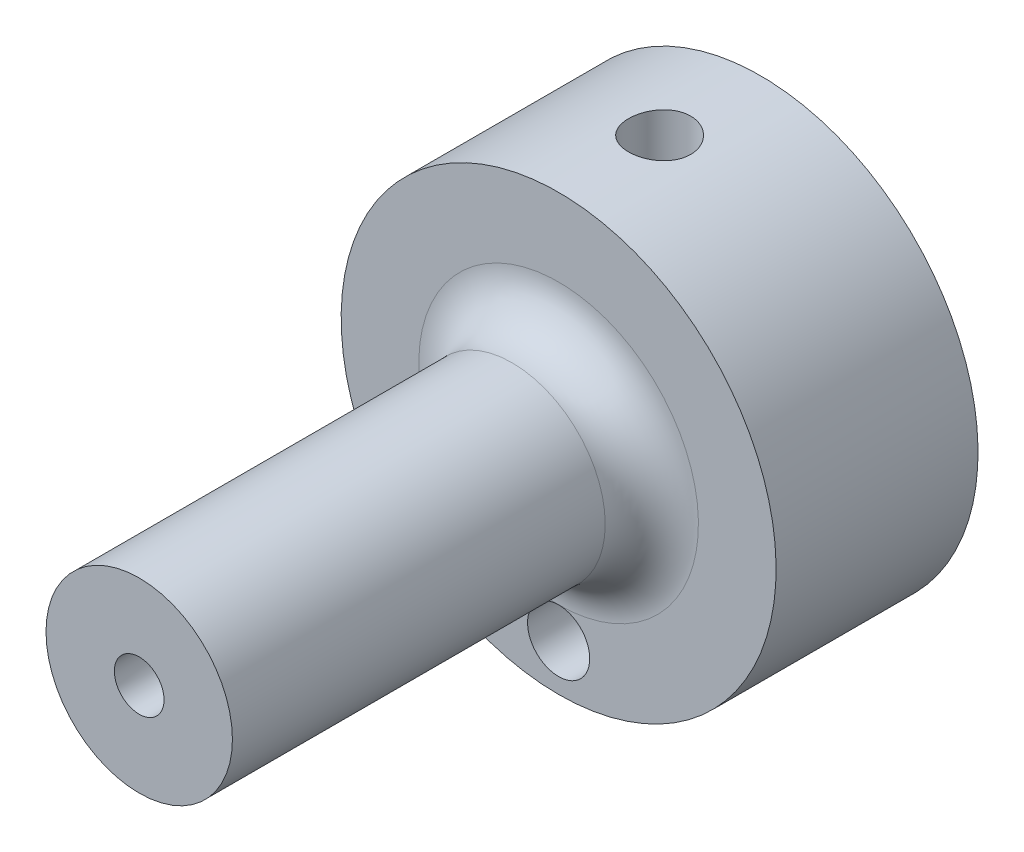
ISO-10303-21;
HEADER;
FILE_DESCRIPTION(('STEP AP214'),'2;1');
FILE_NAME('part.step','',(''),(''),'','','');
FILE_SCHEMA(('AUTOMOTIVE_DESIGN { 1 0 10303 214 1 1 1 1 }'));
ENDSEC;
DATA;
#1=APPLICATION_CONTEXT('core data for automotive mechanical design processes');
#2=APPLICATION_PROTOCOL_DEFINITION('international standard','automotive_design',2000,#1);
#3=PRODUCT_CONTEXT('',#1,'mechanical');
#4=PRODUCT('Part','Part','',(#3));
#5=PRODUCT_RELATED_PRODUCT_CATEGORY('part','',(#4));
#6=PRODUCT_DEFINITION_FORMATION('','',#4);
#7=PRODUCT_DEFINITION_CONTEXT('part definition',#1,'design');
#8=PRODUCT_DEFINITION('design','',#6,#7);
#9=PRODUCT_DEFINITION_SHAPE('','',#8);
#10=(LENGTH_UNIT() NAMED_UNIT(*) SI_UNIT(.MILLI.,.METRE.));
#11=(NAMED_UNIT(*) PLANE_ANGLE_UNIT() SI_UNIT($,.RADIAN.));
#12=(NAMED_UNIT(*) SI_UNIT($,.STERADIAN.) SOLID_ANGLE_UNIT());
#13=UNCERTAINTY_MEASURE_WITH_UNIT(LENGTH_MEASURE(1.E-05),#10,'distance_accuracy_value','');
#14=(GEOMETRIC_REPRESENTATION_CONTEXT(3) GLOBAL_UNCERTAINTY_ASSIGNED_CONTEXT((#13)) GLOBAL_UNIT_ASSIGNED_CONTEXT((#10,
#11,#12)) REPRESENTATION_CONTEXT('',''));
#15=CARTESIAN_POINT('',(0.,0.,0.));
#16=DIRECTION('',(0.,0.,1.));
#17=DIRECTION('',(1.,0.,0.));
#18=AXIS2_PLACEMENT_3D('',#15,#16,#17);
#19=CARTESIAN_POINT('',(0.,0.,27.));
#20=DIRECTION('',(0.,0.,1.));
#21=DIRECTION('',(0.,-1.,0.));
#22=AXIS2_PLACEMENT_3D('',#19,#20,#21);
#23=CONICAL_SURFACE('',#22,1.59907471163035,0.00872664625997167);
#24=CARTESIAN_POINT('',(0.,0.,27.));
#25=DIRECTION('',(0.,0.,1.));
#26=DIRECTION('',(0.,-1.,0.));
#27=AXIS2_PLACEMENT_3D('',#24,#25,#26);
#28=CIRCLE('',#27,1.59907471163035);
#29=CARTESIAN_POINT('',(0.,-1.59907471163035,27.));
#30=VERTEX_POINT('',#29);
#31=EDGE_CURVE('E110',#30,#30,#28,.T.);
#32=ORIENTED_EDGE('',*,*,#31,.T.);
#33=EDGE_LOOP('',(#32));
#34=FACE_BOUND('',#33,.T.);
#35=CARTESIAN_POINT('',(0.,0.,-11.5515133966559));
#36=DIRECTION('',(0.,0.,-1.));
#37=DIRECTION('',(0.,1.,0.));
#38=AXIS2_PLACEMENT_3D('',#35,#36,#37);
#39=CIRCLE('',#38,1.26264075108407);
#40=CARTESIAN_POINT('',(0.,1.26264075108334,-11.5515133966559));
#41=VERTEX_POINT('',#40);
#42=EDGE_CURVE('E38',#41,#41,#39,.F.);
#43=ORIENTED_EDGE('',*,*,#42,.F.);
#44=EDGE_LOOP('',(#43));
#45=FACE_BOUND('',#44,.T.);
#46=ADVANCED_FACE('F34',(#34,#45),#23,.F.);
#47=CARTESIAN_POINT('',(0.,0.,27.));
#48=DIRECTION('',(0.,0.,1.));
#49=DIRECTION('',(0.,-1.,0.));
#50=AXIS2_PLACEMENT_3D('',#47,#48,#49);
#51=CYLINDRICAL_SURFACE('',#50,14.);
#52=CARTESIAN_POINT('',(0.,0.,0.));
#53=DIRECTION('',(0.,0.,1.));
#54=DIRECTION('',(0.,-1.,0.));
#55=AXIS2_PLACEMENT_3D('',#52,#53,#54);
#56=CIRCLE('',#55,14.);
#57=CARTESIAN_POINT('',(0.,-14.,0.));
#58=VERTEX_POINT('',#57);
#59=EDGE_CURVE('E104',#58,#58,#56,.T.);
#60=ORIENTED_EDGE('',*,*,#59,.F.);
#61=EDGE_LOOP('',(#60));
#62=FACE_BOUND('',#61,.T.);
#63=CARTESIAN_POINT('',(0.,0.,-13.));
#64=DIRECTION('',(0.,0.,1.));
#65=DIRECTION('',(0.,-1.,0.));
#66=AXIS2_PLACEMENT_3D('',#63,#64,#65);
#67=CIRCLE('',#66,14.);
#68=CARTESIAN_POINT('',(0.,-14.,-13.));
#69=VERTEX_POINT('',#68);
#70=EDGE_CURVE('E107',#69,#69,#67,.T.);
#71=ORIENTED_EDGE('',*,*,#70,.T.);
#72=EDGE_LOOP('',(#71));
#73=FACE_BOUND('',#72,.T.);
#74=CARTESIAN_POINT('',(0.,14.,-4.5));
#75=CARTESIAN_POINT('',(0.111730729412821,13.9999982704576,-4.50000465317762));
#76=CARTESIAN_POINT('',(0.223527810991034,13.9986484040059,-4.50939441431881));
#77=CARTESIAN_POINT('',(0.444001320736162,13.9933934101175,-4.54669827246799));
#78=CARTESIAN_POINT('',(0.552674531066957,13.9894857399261,-4.57463080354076));
#79=CARTESIAN_POINT('',(0.763677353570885,13.9795546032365,-4.64817212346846));
#80=CARTESIAN_POINT('',(0.866011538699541,13.9735326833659,-4.69376799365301));
#81=CARTESIAN_POINT('',(1.06155930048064,13.9600397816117,-4.80131108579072));
#82=CARTESIAN_POINT('',(1.1547742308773,13.9525690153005,-4.86325587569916));
#83=CARTESIAN_POINT('',(1.33011730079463,13.9369507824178,-5.00220834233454));
#84=CARTESIAN_POINT('',(1.4121711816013,13.9287993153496,-5.07930928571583));
#85=CARTESIAN_POINT('',(1.56222258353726,13.9127699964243,-5.24618482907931));
#86=CARTESIAN_POINT('',(1.63021932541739,13.9048921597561,-5.33596013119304));
#87=CARTESIAN_POINT('',(1.75051175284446,13.8902631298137,-5.52613023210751));
#88=CARTESIAN_POINT('',(1.80273625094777,13.8835171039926,-5.62657049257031));
#89=CARTESIAN_POINT('',(1.8895469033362,13.8719696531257,-5.83490907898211));
#90=CARTESIAN_POINT('',(1.92413392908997,13.8671681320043,-5.94280703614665));
#91=CARTESIAN_POINT('',(1.97445864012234,13.8600923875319,-6.16222001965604));
#92=CARTESIAN_POINT('',(1.99032297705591,13.8578011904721,-6.27370543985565));
#93=CARTESIAN_POINT('',(2.00314420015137,13.8559538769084,-6.4977778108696));
#94=CARTESIAN_POINT('',(2.00010207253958,13.8563976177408,-6.61036470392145));
#95=CARTESIAN_POINT('',(1.97530036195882,13.8599545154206,-6.83255309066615));
#96=CARTESIAN_POINT('',(1.95368136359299,13.8630476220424,-6.94217064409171));
#97=CARTESIAN_POINT('',(1.89255944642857,13.8715234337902,-7.15620617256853));
#98=CARTESIAN_POINT('',(1.85305606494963,13.8769061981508,-7.26062401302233));
#99=CARTESIAN_POINT('',(1.75713904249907,13.8893771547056,-7.46172654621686));
#100=CARTESIAN_POINT('',(1.70066538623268,13.8964713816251,-7.55838222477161));
#101=CARTESIAN_POINT('',(1.57245369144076,13.9115614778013,-7.7408984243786));
#102=CARTESIAN_POINT('',(1.50071474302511,13.9195574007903,-7.82675830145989));
#103=CARTESIAN_POINT('',(1.34323491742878,13.935638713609,-7.98606080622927));
#104=CARTESIAN_POINT('',(1.25737307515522,13.9437242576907,-8.05938389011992));
#105=CARTESIAN_POINT('',(1.07449831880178,13.9590063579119,-8.19059700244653));
#106=CARTESIAN_POINT('',(0.97748536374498,13.9662029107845,-8.24848697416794));
#107=CARTESIAN_POINT('',(0.774962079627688,13.9789027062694,-8.34719487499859));
#108=CARTESIAN_POINT('',(0.66944745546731,13.9844050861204,-8.38800410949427));
#109=CARTESIAN_POINT('',(0.452966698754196,13.9930891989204,-8.4512909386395));
#110=CARTESIAN_POINT('',(0.342000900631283,13.9962710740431,-8.47376965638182));
#111=CARTESIAN_POINT('',(0.118800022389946,13.9999369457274,-8.49959962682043));
#112=CARTESIAN_POINT('',(0.00658433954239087,14.0004441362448,-8.5031153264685));
#113=CARTESIAN_POINT('',(-0.216834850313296,13.998766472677,-8.49135519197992));
#114=CARTESIAN_POINT('',(-0.328038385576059,13.9965816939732,-8.47607988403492));
#115=CARTESIAN_POINT('',(-0.545782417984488,13.989779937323,-8.42730805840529));
#116=CARTESIAN_POINT('',(-0.652341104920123,13.9851735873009,-8.39389114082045));
#117=CARTESIAN_POINT('',(-0.858342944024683,13.9740437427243,-8.30986826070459));
#118=CARTESIAN_POINT('',(-0.957785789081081,13.9675201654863,-8.25926155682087));
#119=CARTESIAN_POINT('',(-1.14745969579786,13.9532237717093,-8.14190618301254));
#120=CARTESIAN_POINT('',(-1.23762521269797,13.9454429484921,-8.07505257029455));
#121=CARTESIAN_POINT('',(-1.40551529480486,13.9295244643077,-7.92724792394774));
#122=CARTESIAN_POINT('',(-1.48323920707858,13.9213867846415,-7.84629615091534));
#123=CARTESIAN_POINT('',(-1.62463364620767,13.905598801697,-7.67186329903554));
#124=CARTESIAN_POINT('',(-1.68819430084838,13.8979526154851,-7.57829272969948));
#125=CARTESIAN_POINT('',(-1.79869568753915,13.8840847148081,-7.38170681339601));
#126=CARTESIAN_POINT('',(-1.84563683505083,13.8778629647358,-7.27869170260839));
#127=CARTESIAN_POINT('',(-1.92139410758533,13.8675777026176,-7.06647669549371));
#128=CARTESIAN_POINT('',(-1.95026930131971,13.8635071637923,-6.95729824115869));
#129=CARTESIAN_POINT('',(-1.98926373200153,13.8579660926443,-6.7355794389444));
#130=CARTESIAN_POINT('',(-1.99938413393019,13.8564953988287,-6.62303930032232));
#131=CARTESIAN_POINT('',(-2.00055590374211,13.8563261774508,-6.39888617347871));
#132=CARTESIAN_POINT('',(-1.99177997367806,13.8576025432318,-6.28727406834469));
#133=CARTESIAN_POINT('',(-1.955776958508,13.8627292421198,-6.06712987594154));
#134=CARTESIAN_POINT('',(-1.92854989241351,13.8665795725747,-5.95859778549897));
#135=CARTESIAN_POINT('',(-1.85647645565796,13.8764118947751,-5.74773473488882));
#136=CARTESIAN_POINT('',(-1.81164102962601,13.8823925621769,-5.64539996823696));
#137=CARTESIAN_POINT('',(-1.70564064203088,13.8958134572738,-5.4496775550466));
#138=CARTESIAN_POINT('',(-1.6444752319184,13.9032537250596,-5.35629015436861));
#139=CARTESIAN_POINT('',(-1.50691947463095,13.9188366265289,-5.18023418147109));
#140=CARTESIAN_POINT('',(-1.43040092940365,13.9269848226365,-5.09766625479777));
#141=CARTESIAN_POINT('',(-1.26458151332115,13.9430182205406,-4.94648029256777));
#142=CARTESIAN_POINT('',(-1.17527766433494,13.9509033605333,-4.87786551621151));
#143=CARTESIAN_POINT('',(-0.985903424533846,13.9655666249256,-4.75623242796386));
#144=CARTESIAN_POINT('',(-0.885781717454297,13.9723390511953,-4.70329334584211));
#145=CARTESIAN_POINT('',(-0.678021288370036,13.9839575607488,-4.6150602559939));
#146=CARTESIAN_POINT('',(-0.570390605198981,13.9888056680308,-4.57974769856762));
#147=CARTESIAN_POINT('',(-0.385211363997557,13.9949036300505,-4.53591641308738));
#148=CARTESIAN_POINT('',(-0.308813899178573,13.9968051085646,-4.52246796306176));
#149=CARTESIAN_POINT('',(-0.154954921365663,13.9993538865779,-4.5045081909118));
#150=CARTESIAN_POINT('',(-0.0774934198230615,14.0000011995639,-4.49999677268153));
#151=CARTESIAN_POINT('',(0.,14.,-4.5));
#152=B_SPLINE_CURVE_WITH_KNOTS('',3,(#74,#75,#76,#77,#78,#79,#80,#81,#82,#83,#84,#85,#86,#87,
#88,#89,#90,#91,#92,#93,#94,#95,#96,#97,#98,#99,#100,#101,#102,#103,#104,#105,#106,#107,#108,
#109,#110,#111,#112,#113,#114,#115,#116,#117,#118,#119,#120,#121,#122,#123,#124,#125,#126,#127,
#128,#129,#130,#131,#132,#133,#134,#135,#136,#137,#138,#139,#140,#141,#142,#143,#144,#145,#146,
#147,#148,#149,#150,#151),.UNSPECIFIED.,.T.,.F.,(4,2,2,2,2,2,2,2,2,2,2,2,2,2,2,2,2,2,2,2,2,2,2,
2,2,2,2,2,2,2,2,2,2,2,2,2,2,2,4),(0.,0.334909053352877,0.670151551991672,1.0051493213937,
1.34009728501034,1.67717486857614,2.01427113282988,2.35286688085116,2.69144589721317,
3.02772118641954,3.36397893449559,3.69771416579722,4.03145803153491,4.36639635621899,
4.70135465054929,5.03934756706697,5.37734172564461,5.71550772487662,6.05365300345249,
6.38886112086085,6.7240598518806,7.05779957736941,7.39155369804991,7.7275237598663,
8.06351144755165,8.40202124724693,8.74052258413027,9.0779112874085,9.41527903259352,
9.74957651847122,10.0838736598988,10.4179633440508,10.7520622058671,11.0890764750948,
11.4261693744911,11.7649380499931,12.1033494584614,12.3356358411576,12.5679197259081),.UNSPECIFIED.);
#153=CARTESIAN_POINT('',(0.,14.,-4.5));
#154=VERTEX_POINT('',#153);
#155=EDGE_CURVE('E11',#154,#154,#152,.T.);
#156=ORIENTED_EDGE('',*,*,#155,.F.);
#157=EDGE_LOOP('',(#156));
#158=FACE_BOUND('',#157,.T.);
#159=ADVANCED_FACE('F71',(#62,#73,#158),#51,.T.);
#160=CARTESIAN_POINT('',(0.,6.,27.));
#161=DIRECTION('',(0.,0.,-1.));
#162=DIRECTION('',(0.,1.,0.));
#163=AXIS2_PLACEMENT_3D('',#160,#161,#162);
#164=PLANE('',#163);
#165=ORIENTED_EDGE('',*,*,#31,.F.);
#166=EDGE_LOOP('',(#165));
#167=FACE_BOUND('',#166,.T.);
#168=CARTESIAN_POINT('',(0.,0.,27.));
#169=DIRECTION('',(0.,0.,1.));
#170=DIRECTION('',(0.,-1.,0.));
#171=AXIS2_PLACEMENT_3D('',#168,#169,#170);
#172=CIRCLE('',#171,6.);
#173=CARTESIAN_POINT('',(0.,-6.,27.));
#174=VERTEX_POINT('',#173);
#175=EDGE_CURVE('E43',#174,#174,#172,.T.);
#176=ORIENTED_EDGE('',*,*,#175,.T.);
#177=EDGE_LOOP('',(#176));
#178=FACE_BOUND('',#177,.T.);
#179=ADVANCED_FACE('F36',(#167,#178),#164,.F.);
#180=CARTESIAN_POINT('',(0.,0.,27.));
#181=DIRECTION('',(0.,0.,1.));
#182=DIRECTION('',(0.,-1.,0.));
#183=AXIS2_PLACEMENT_3D('',#180,#181,#182);
#184=CYLINDRICAL_SURFACE('',#183,6.);
#185=ORIENTED_EDGE('',*,*,#175,.F.);
#186=EDGE_LOOP('',(#185));
#187=FACE_BOUND('',#186,.T.);
#188=CARTESIAN_POINT('',(0.,0.,3.));
#189=DIRECTION('',(0.,0.,1.));
#190=DIRECTION('',(0.,-1.,0.));
#191=AXIS2_PLACEMENT_3D('',#188,#189,#190);
#192=CIRCLE('',#191,6.);
#193=CARTESIAN_POINT('',(0.,-6.,3.));
#194=VERTEX_POINT('',#193);
#195=EDGE_CURVE('E98',#194,#194,#192,.T.);
#196=ORIENTED_EDGE('',*,*,#195,.T.);
#197=EDGE_LOOP('',(#196));
#198=FACE_BOUND('',#197,.T.);
#199=ADVANCED_FACE('F179',(#187,#198),#184,.T.);
#200=CARTESIAN_POINT('',(0.,0.,3.));
#201=DIRECTION('',(0.,0.,1.));
#202=DIRECTION('',(0.,-1.,0.));
#203=AXIS2_PLACEMENT_3D('',#200,#201,#202);
#204=TOROIDAL_SURFACE('',#203,9.,3.);
#205=ORIENTED_EDGE('',*,*,#195,.F.);
#206=EDGE_LOOP('',(#205));
#207=FACE_BOUND('',#206,.T.);
#208=CARTESIAN_POINT('',(0.,0.,0.));
#209=DIRECTION('',(0.,0.,1.));
#210=DIRECTION('',(0.,-1.,0.));
#211=AXIS2_PLACEMENT_3D('',#208,#209,#210);
#212=CIRCLE('',#211,9.00000000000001);
#213=CARTESIAN_POINT('',(0.,-9.00000000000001,0.));
#214=VERTEX_POINT('',#213);
#215=EDGE_CURVE('E101',#214,#214,#212,.T.);
#216=ORIENTED_EDGE('',*,*,#215,.T.);
#217=EDGE_LOOP('',(#216));
#218=FACE_BOUND('',#217,.T.);
#219=ADVANCED_FACE('F175',(#207,#218),#204,.F.);
#220=CARTESIAN_POINT('',(0.,14.,0.));
#221=DIRECTION('',(0.,0.,-1.));
#222=DIRECTION('',(0.,1.,0.));
#223=AXIS2_PLACEMENT_3D('',#220,#221,#222);
#224=PLANE('',#223);
#225=ORIENTED_EDGE('',*,*,#215,.F.);
#226=CARTESIAN_POINT('',(0.,-11.,0.));
#227=DIRECTION('',(0.,0.,1.));
#228=DIRECTION('',(1.,0.,0.));
#229=AXIS2_PLACEMENT_3D('',#226,#227,#228);
#230=CIRCLE('',#229,2.);
#231=EDGE_CURVE('E48',#214,#214,#230,.T.);
#232=ORIENTED_EDGE('',*,*,#231,.F.);
#233=EDGE_LOOP('',(#225,#232));
#234=FACE_BOUND('',#233,.T.);
#235=ORIENTED_EDGE('',*,*,#59,.T.);
#236=EDGE_LOOP('',(#235));
#237=FACE_BOUND('',#236,.T.);
#238=ADVANCED_FACE('F88',(#234,#237),#224,.F.);
#239=CARTESIAN_POINT('',(0.,1.25,-13.));
#240=DIRECTION('',(0.,0.,1.));
#241=DIRECTION('',(0.,-1.,0.));
#242=AXIS2_PLACEMENT_3D('',#239,#240,#241);
#243=PLANE('',#242);
#244=CARTESIAN_POINT('',(0.,0.,-13.));
#245=DIRECTION('',(0.,0.,1.));
#246=DIRECTION('',(0.,-1.,0.));
#247=AXIS2_PLACEMENT_3D('',#244,#245,#246);
#248=CIRCLE('',#247,6.65206734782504);
#249=CARTESIAN_POINT('',(0.,6.65206734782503,-13.));
#250=VERTEX_POINT('',#249);
#251=EDGE_CURVE('E118',#250,#250,#248,.T.);
#252=ORIENTED_EDGE('',*,*,#251,.T.);
#253=EDGE_LOOP('',(#252));
#254=FACE_BOUND('',#253,.T.);
#255=ORIENTED_EDGE('',*,*,#70,.F.);
#256=EDGE_LOOP('',(#255));
#257=FACE_BOUND('',#256,.T.);
#258=ADVANCED_FACE('F86',(#254,#257),#243,.F.);
#259=CARTESIAN_POINT('',(0.,14.,-6.5));
#260=DIRECTION('',(0.,1.,0.));
#261=DIRECTION('',(0.,0.,1.));
#262=AXIS2_PLACEMENT_3D('',#259,#260,#261);
#263=CYLINDRICAL_SURFACE('',#262,2.);
#264=CARTESIAN_POINT('',(0.,8.,-6.5));
#265=DIRECTION('',(0.,1.,0.));
#266=DIRECTION('',(0.,0.,1.));
#267=AXIS2_PLACEMENT_3D('',#264,#265,#266);
#268=CIRCLE('',#267,2.);
#269=CARTESIAN_POINT('',(0.,8.,-4.5));
#270=VERTEX_POINT('',#269);
#271=EDGE_CURVE('E112',#270,#270,#268,.T.);
#272=ORIENTED_EDGE('',*,*,#271,.F.);
#273=EDGE_LOOP('',(#272));
#274=FACE_BOUND('',#273,.T.);
#275=ORIENTED_EDGE('',*,*,#155,.T.);
#276=EDGE_LOOP('',(#275));
#277=FACE_BOUND('',#276,.T.);
#278=ADVANCED_FACE('F83',(#274,#277),#263,.F.);
#279=CARTESIAN_POINT('',(0.,6.79827876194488,-6.5));
#280=DIRECTION('',(0.,1.,0.));
#281=DIRECTION('',(0.,0.,1.));
#282=AXIS2_PLACEMENT_3D('',#279,#280,#281);
#283=CONICAL_SURFACE('',#282,0.,1.02974425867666);
#284=ORIENTED_EDGE('',*,*,#271,.T.);
#285=EDGE_LOOP('',(#284));
#286=FACE_BOUND('',#285,.T.);
#287=CARTESIAN_POINT('',(0.,6.79827876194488,-6.5));
#288=VERTEX_POINT('',#287);
#289=VERTEX_LOOP('',#288);
#290=FACE_BOUND('',#289,.T.);
#291=ADVANCED_FACE('F67',(#286,#290),#283,.F.);
#292=CARTESIAN_POINT('',(0.,-11.,0.));
#293=DIRECTION('',(0.,0.,1.));
#294=DIRECTION('',(1.,0.,0.));
#295=AXIS2_PLACEMENT_3D('',#292,#293,#294);
#296=CYLINDRICAL_SURFACE('',#295,2.);
#297=ORIENTED_EDGE('',*,*,#231,.T.);
#298=EDGE_LOOP('',(#297));
#299=FACE_BOUND('',#298,.T.);
#300=CARTESIAN_POINT('',(0.,-11.,-6.00000000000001));
#301=DIRECTION('',(0.,0.,1.));
#302=DIRECTION('',(1.,0.,0.));
#303=AXIS2_PLACEMENT_3D('',#300,#301,#302);
#304=CIRCLE('',#303,2.);
#305=CARTESIAN_POINT('',(2.,-11.,-6.00000000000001));
#306=VERTEX_POINT('',#305);
#307=EDGE_CURVE('E116',#306,#306,#304,.T.);
#308=ORIENTED_EDGE('',*,*,#307,.F.);
#309=EDGE_LOOP('',(#308));
#310=FACE_BOUND('',#309,.T.);
#311=ADVANCED_FACE('F58',(#299,#310),#296,.F.);
#312=CARTESIAN_POINT('',(0.,-11.,-7.20172123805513));
#313=DIRECTION('',(0.,0.,1.));
#314=DIRECTION('',(1.,0.,0.));
#315=AXIS2_PLACEMENT_3D('',#312,#313,#314);
#316=CONICAL_SURFACE('',#315,0.,1.02974425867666);
#317=ORIENTED_EDGE('',*,*,#307,.T.);
#318=EDGE_LOOP('',(#317));
#319=FACE_BOUND('',#318,.T.);
#320=CARTESIAN_POINT('',(0.,-11.,-7.20172123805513));
#321=VERTEX_POINT('',#320);
#322=VERTEX_LOOP('',#321);
#323=FACE_BOUND('',#322,.T.);
#324=ADVANCED_FACE('F55',(#319,#323),#316,.F.);
#325=CARTESIAN_POINT('',(0.,0.,-27.));
#326=DIRECTION('',(0.,0.,1.));
#327=DIRECTION('',(0.,1.,0.));
#328=AXIS2_PLACEMENT_3D('',#325,#326,#327);
#329=SPHERICAL_SURFACE('',#328,15.5);
#330=CARTESIAN_POINT('',(0.,6.65206734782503,-13.));
#331=CARTESIAN_POINT('',(0.,6.59927309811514,-12.974914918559));
#332=CARTESIAN_POINT('',(0.,6.54633694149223,-12.9501284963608));
#333=CARTESIAN_POINT('',(0.,6.44018761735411,-12.9011560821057));
#334=CARTESIAN_POINT('',(0.,6.38697444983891,-12.8769700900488));
#335=CARTESIAN_POINT('',(0.,6.28027790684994,-12.8292016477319));
#336=CARTESIAN_POINT('',(0.,6.22679453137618,-12.8056191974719));
#337=CARTESIAN_POINT('',(0.,6.11956441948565,-12.7590608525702));
#338=CARTESIAN_POINT('',(0.,6.06581768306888,-12.7360849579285));
#339=CARTESIAN_POINT('',(0.,5.95806772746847,-12.6907426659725));
#340=CARTESIAN_POINT('',(0.,5.90406450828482,-12.6683762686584));
#341=CARTESIAN_POINT('',(0.,5.79580849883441,-12.6242558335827));
#342=CARTESIAN_POINT('',(0.,5.74155570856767,-12.6025017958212));
#343=CARTESIAN_POINT('',(0.,5.63280750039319,-12.5596088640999));
#344=CARTESIAN_POINT('',(0.,5.57831208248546,-12.5384699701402));
#345=CARTESIAN_POINT('',(0.,5.46908559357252,-12.4968100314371));
#346=CARTESIAN_POINT('',(0.,5.4143545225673,-12.4762889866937));
#347=CARTESIAN_POINT('',(0.,5.30466373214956,-12.4358673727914));
#348=CARTESIAN_POINT('',(0.,5.24970401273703,-12.4159668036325));
#349=CARTESIAN_POINT('',(0.,5.13956295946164,-12.376788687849));
#350=CARTESIAN_POINT('',(0.,5.08438162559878,-12.3575111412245));
#351=CARTESIAN_POINT('',(0.,4.97380440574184,-12.3195815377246));
#352=CARTESIAN_POINT('',(0.,4.91840851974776,-12.3009294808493));
#353=CARTESIAN_POINT('',(0.,4.80740928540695,-12.2642532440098));
#354=CARTESIAN_POINT('',(0.,4.75180593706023,-12.2462290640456));
#355=CARTESIAN_POINT('',(0.,4.64039889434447,-12.2108108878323));
#356=CARTESIAN_POINT('',(0.,4.58459519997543,-12.1934168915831));
#357=CARTESIAN_POINT('',(0.,4.47279460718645,-12.1592613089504));
#358=CARTESIAN_POINT('',(0.,4.41679770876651,-12.1424997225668));
#359=CARTESIAN_POINT('',(0.,4.30461787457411,-12.1096111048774));
#360=CARTESIAN_POINT('',(0.,4.24843493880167,-12.0934840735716));
#361=CARTESIAN_POINT('',(0.,4.13589022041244,-12.0618666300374));
#362=CARTESIAN_POINT('',(0.,4.07952843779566,-12.046376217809));
#363=CARTESIAN_POINT('',(0.,3.96663323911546,-12.0160339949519));
#364=CARTESIAN_POINT('',(0.,3.91009982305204,-12.0011821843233));
#365=CARTESIAN_POINT('',(0.,3.79686859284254,-11.9721190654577));
#366=CARTESIAN_POINT('',(0.,3.74017077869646,-11.9579077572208));
#367=CARTESIAN_POINT('',(0.,3.62661800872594,-11.9301274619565));
#368=CARTESIAN_POINT('',(0.,3.56976305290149,-11.9165584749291));
#369=CARTESIAN_POINT('',(0.,3.45590327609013,-11.8900645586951));
#370=CARTESIAN_POINT('',(0.,3.39889845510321,-11.8771396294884));
#371=CARTESIAN_POINT('',(0.,3.2847462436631,-11.8519354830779));
#372=CARTESIAN_POINT('',(0.,3.22759885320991,-11.8396562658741));
#373=CARTESIAN_POINT('',(0.,3.11316881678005,-11.8157451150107));
#374=CARTESIAN_POINT('',(0.,3.05588617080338,-11.8041131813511));
#375=CARTESIAN_POINT('',(0.,2.94119295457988,-11.781498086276));
#376=CARTESIAN_POINT('',(0.,2.88378238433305,-11.7705149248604));
#377=CARTESIAN_POINT('',(0.,2.76884066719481,-11.74919877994));
#378=CARTESIAN_POINT('',(0.,2.71130952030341,-11.7388657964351));
#379=CARTESIAN_POINT('',(0.,2.5961340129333,-11.7188513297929));
#380=CARTESIAN_POINT('',(0.,2.53848965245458,-11.7091698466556));
#381=CARTESIAN_POINT('',(0.,2.42309509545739,-11.6904596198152));
#382=CARTESIAN_POINT('',(0.,2.36534489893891,-11.6814308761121));
#383=CARTESIAN_POINT('',(0.,2.24974606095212,-11.6640272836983));
#384=CARTESIAN_POINT('',(0.,2.19189741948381,-11.6556524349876));
#385=CARTESIAN_POINT('',(0.,2.07610909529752,-11.6395577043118));
#386=CARTESIAN_POINT('',(0.,2.01816941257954,-11.6318378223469));
#387=CARTESIAN_POINT('',(0.,1.90220642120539,-11.6170540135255));
#388=CARTESIAN_POINT('',(0.,1.84418311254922,-11.6099900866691));
#389=CARTESIAN_POINT('',(0.,1.72806029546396,-11.596519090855));
#390=CARTESIAN_POINT('',(0.,1.66996078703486,-11.5901120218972));
#391=CARTESIAN_POINT('',(0.,1.55369300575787,-11.577955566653));
#392=CARTESIAN_POINT('',(0.,1.49552473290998,-11.5722061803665));
#393=CARTESIAN_POINT('',(0.,1.37912686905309,-11.5613658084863));
#394=CARTESIAN_POINT('',(0.,1.32089727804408,-11.5562748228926));
#395=CARTESIAN_POINT('',(0.,1.26264075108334,-11.5515133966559));
#396=B_SPLINE_CURVE_WITH_KNOTS('',3,(#330,#331,#332,#333,#334,#335,#336,#337,#338,#339,#340,
#341,#342,#343,#344,#345,#346,#347,#348,#349,#350,#351,#352,#353,#354,#355,#356,#357,#358,#359,
#360,#361,#362,#363,#364,#365,#366,#367,#368,#369,#370,#371,#372,#373,#374,#375,#376,#377,#378,
#379,#380,#381,#382,#383,#384,#385,#386,#387,#388,#389,#390,#391,#392,#393,#394,#395),
.UNSPECIFIED.,.F.,.F.,(4,2,2,2,2,2,2,2,2,2,2,2,2,2,2,2,2,2,2,2,2,2,2,2,2,2,2,2,2,2,2,2,4),(0.,
0.175351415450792,0.350702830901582,0.526054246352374,0.701405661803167,0.876757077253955,
1.05210849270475,1.22745990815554,1.40281132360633,1.57816273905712,1.75351415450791,
1.9288655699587,2.10421698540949,2.27956840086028,2.45491981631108,2.63027123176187,
2.80562264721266,2.98097406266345,3.15632547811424,3.33167689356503,3.50702830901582,
3.68237972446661,3.8577311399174,4.0330825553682,4.20843397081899,4.38378538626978,
4.55913680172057,4.73448821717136,4.90983963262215,5.08519104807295,5.26054246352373,
5.43589387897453,5.61124529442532),.UNSPECIFIED.);
#397=EDGE_CURVE('BSEAM57',#250,#41,#396,.T.);
#398=ORIENTED_EDGE('',*,*,#251,.F.);
#399=ORIENTED_EDGE('',*,*,#42,.T.);
#400=ORIENTED_EDGE('',*,*,#397,.T.);
#401=ORIENTED_EDGE('',*,*,#397,.F.);
#402=EDGE_LOOP('',(#398,#400,#399,#401));
#403=FACE_BOUND('',#402,.T.);
#404=ADVANCED_FACE('F57',(#403),#329,.F.);
#405=CLOSED_SHELL('',(#46,#159,#179,#199,#219,#238,#258,#278,#291,#311,#324,#404));
#406=MANIFOLD_SOLID_BREP('B2',#405);
#407=ADVANCED_BREP_SHAPE_REPRESENTATION('',(#18,#406),#14);
#408=SHAPE_DEFINITION_REPRESENTATION(#9,#407);
ENDSEC;
END-ISO-10303-21;
